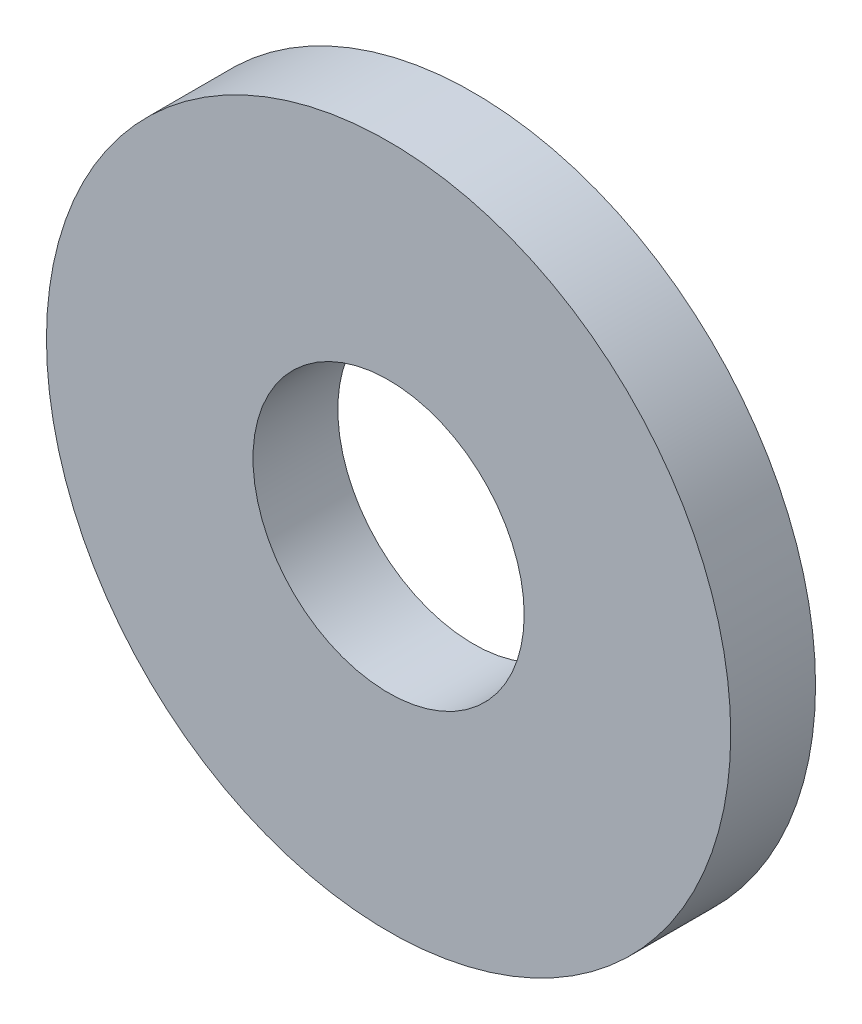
ISO-10303-21;
HEADER;
FILE_DESCRIPTION(('STEP AP214'),'2;1');
FILE_NAME('part.step','',(''),(''),'','','');
FILE_SCHEMA(('AUTOMOTIVE_DESIGN { 1 0 10303 214 1 1 1 1 }'));
ENDSEC;
DATA;
#1=APPLICATION_CONTEXT('core data for automotive mechanical design processes');
#2=APPLICATION_PROTOCOL_DEFINITION('international standard','automotive_design',2000,#1);
#3=PRODUCT_CONTEXT('',#1,'mechanical');
#4=PRODUCT('Part','Part','',(#3));
#5=PRODUCT_RELATED_PRODUCT_CATEGORY('part','',(#4));
#6=PRODUCT_DEFINITION_FORMATION('','',#4);
#7=PRODUCT_DEFINITION_CONTEXT('part definition',#1,'design');
#8=PRODUCT_DEFINITION('design','',#6,#7);
#9=PRODUCT_DEFINITION_SHAPE('','',#8);
#10=(LENGTH_UNIT() NAMED_UNIT(*) SI_UNIT(.MILLI.,.METRE.));
#11=(NAMED_UNIT(*) PLANE_ANGLE_UNIT() SI_UNIT($,.RADIAN.));
#12=(NAMED_UNIT(*) SI_UNIT($,.STERADIAN.) SOLID_ANGLE_UNIT());
#13=UNCERTAINTY_MEASURE_WITH_UNIT(LENGTH_MEASURE(1.E-05),#10,'distance_accuracy_value','');
#14=(GEOMETRIC_REPRESENTATION_CONTEXT(3) GLOBAL_UNCERTAINTY_ASSIGNED_CONTEXT((#13)) GLOBAL_UNIT_ASSIGNED_CONTEXT((#10,
#11,#12)) REPRESENTATION_CONTEXT('',''));
#15=CARTESIAN_POINT('',(0.,0.,0.));
#16=DIRECTION('',(0.,0.,1.));
#17=DIRECTION('',(1.,0.,0.));
#18=AXIS2_PLACEMENT_3D('',#15,#16,#17);
#19=CARTESIAN_POINT('',(38.3796142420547,299.393845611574,2.));
#20=DIRECTION('',(0.,0.,1.));
#21=DIRECTION('',(1.,0.,0.));
#22=AXIS2_PLACEMENT_3D('',#19,#20,#21);
#23=PLANE('',#22);
#24=CARTESIAN_POINT('',(38.3796142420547,299.393845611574,2.));
#25=DIRECTION('',(0.,0.,1.));
#26=DIRECTION('',(1.,0.,0.));
#27=AXIS2_PLACEMENT_3D('',#24,#25,#26);
#28=CIRCLE('',#27,8.06772892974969);
#29=CARTESIAN_POINT('',(46.4473431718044,299.393845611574,2.));
#30=VERTEX_POINT('',#29);
#31=EDGE_CURVE('E10',#30,#30,#28,.T.);
#32=ORIENTED_EDGE('',*,*,#31,.T.);
#33=EDGE_LOOP('',(#32));
#34=FACE_BOUND('',#33,.T.);
#35=CARTESIAN_POINT('',(38.3796142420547,299.393845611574,2.));
#36=DIRECTION('',(0.,0.,1.));
#37=DIRECTION('',(1.,0.,0.));
#38=AXIS2_PLACEMENT_3D('',#35,#36,#37);
#39=CIRCLE('',#38,3.19730266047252);
#40=CARTESIAN_POINT('',(41.5769169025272,299.393845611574,2.));
#41=VERTEX_POINT('',#40);
#42=EDGE_CURVE('E39',#41,#41,#39,.T.);
#43=ORIENTED_EDGE('',*,*,#42,.F.);
#44=EDGE_LOOP('',(#43));
#45=FACE_BOUND('',#44,.T.);
#46=ADVANCED_FACE('F28',(#34,#45),#23,.T.);
#47=CARTESIAN_POINT('',(38.3796142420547,299.393845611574,0.));
#48=DIRECTION('',(0.,0.,1.));
#49=DIRECTION('',(1.,0.,0.));
#50=AXIS2_PLACEMENT_3D('',#47,#48,#49);
#51=PLANE('',#50);
#52=CARTESIAN_POINT('',(38.3796142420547,299.393845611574,0.));
#53=DIRECTION('',(0.,0.,1.));
#54=DIRECTION('',(1.,0.,0.));
#55=AXIS2_PLACEMENT_3D('',#52,#53,#54);
#56=CIRCLE('',#55,8.06772892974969);
#57=CARTESIAN_POINT('',(46.4473431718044,299.393845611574,0.));
#58=VERTEX_POINT('',#57);
#59=EDGE_CURVE('E32',#58,#58,#56,.T.);
#60=ORIENTED_EDGE('',*,*,#59,.F.);
#61=EDGE_LOOP('',(#60));
#62=FACE_BOUND('',#61,.T.);
#63=CARTESIAN_POINT('',(38.3796142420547,299.393845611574,0.));
#64=DIRECTION('',(0.,0.,1.));
#65=DIRECTION('',(1.,0.,0.));
#66=AXIS2_PLACEMENT_3D('',#63,#64,#65);
#67=CIRCLE('',#66,3.19730266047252);
#68=CARTESIAN_POINT('',(41.5769169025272,299.393845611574,0.));
#69=VERTEX_POINT('',#68);
#70=EDGE_CURVE('E41',#69,#69,#67,.T.);
#71=ORIENTED_EDGE('',*,*,#70,.T.);
#72=EDGE_LOOP('',(#71));
#73=FACE_BOUND('',#72,.T.);
#74=ADVANCED_FACE('F51',(#62,#73),#51,.F.);
#75=CARTESIAN_POINT('',(38.3796142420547,299.393845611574,2.));
#76=DIRECTION('',(0.,0.,-1.));
#77=DIRECTION('',(-1.,0.,0.));
#78=AXIS2_PLACEMENT_3D('',#75,#76,#77);
#79=CYLINDRICAL_SURFACE('',#78,8.06772892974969);
#80=ORIENTED_EDGE('',*,*,#31,.F.);
#81=EDGE_LOOP('',(#80));
#82=FACE_BOUND('',#81,.T.);
#83=ORIENTED_EDGE('',*,*,#59,.T.);
#84=EDGE_LOOP('',(#83));
#85=FACE_BOUND('',#84,.T.);
#86=ADVANCED_FACE('F30',(#82,#85),#79,.T.);
#87=CARTESIAN_POINT('',(38.3796142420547,299.393845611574,2.));
#88=DIRECTION('',(0.,0.,-1.));
#89=DIRECTION('',(-1.,0.,0.));
#90=AXIS2_PLACEMENT_3D('',#87,#88,#89);
#91=CYLINDRICAL_SURFACE('',#90,3.19730266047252);
#92=ORIENTED_EDGE('',*,*,#42,.T.);
#93=EDGE_LOOP('',(#92));
#94=FACE_BOUND('',#93,.T.);
#95=ORIENTED_EDGE('',*,*,#70,.F.);
#96=EDGE_LOOP('',(#95));
#97=FACE_BOUND('',#96,.T.);
#98=ADVANCED_FACE('F47',(#94,#97),#91,.F.);
#99=CLOSED_SHELL('',(#46,#74,#86,#98));
#100=MANIFOLD_SOLID_BREP('B2',#99);
#101=ADVANCED_BREP_SHAPE_REPRESENTATION('',(#18,#100),#14);
#102=SHAPE_DEFINITION_REPRESENTATION(#9,#101);
ENDSEC;
END-ISO-10303-21;
